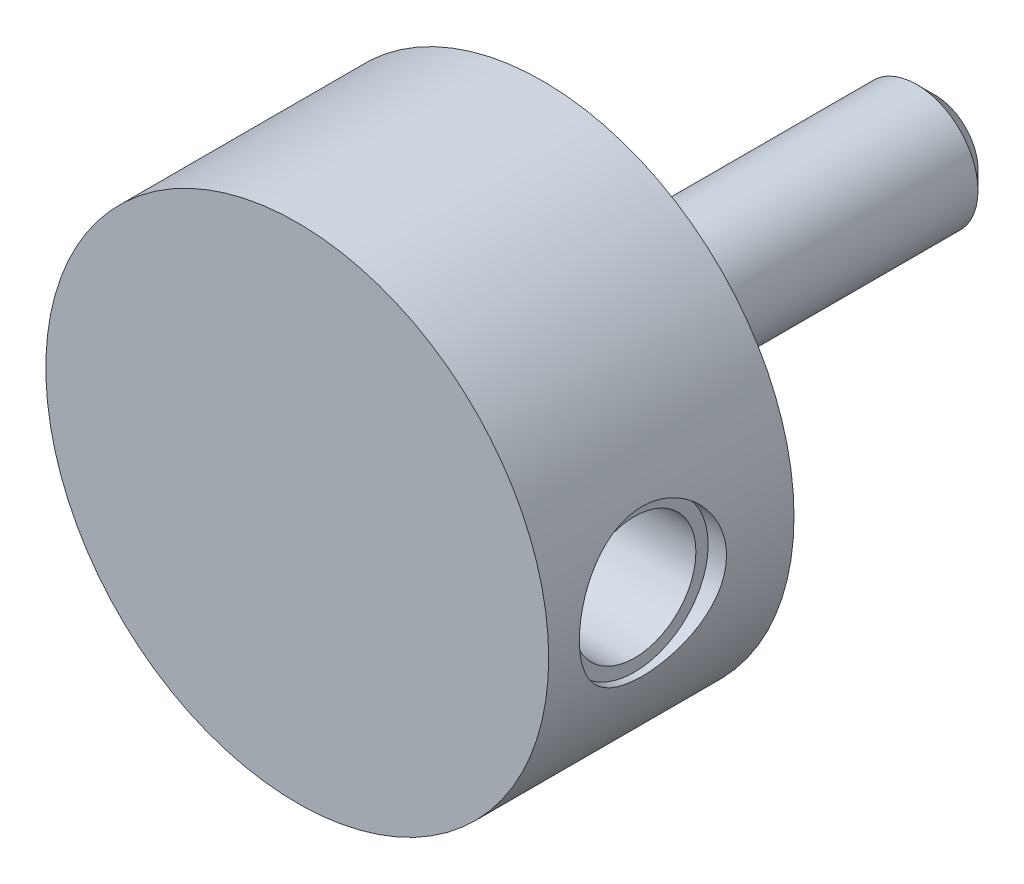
ISO-10303-21;
HEADER;
FILE_DESCRIPTION(('STEP AP214'),'2;1');
FILE_NAME('part.step','',(''),(''),'','','');
FILE_SCHEMA(('AUTOMOTIVE_DESIGN { 1 0 10303 214 1 1 1 1 }'));
ENDSEC;
DATA;
#1=APPLICATION_CONTEXT('core data for automotive mechanical design processes');
#2=APPLICATION_PROTOCOL_DEFINITION('international standard','automotive_design',2000,#1);
#3=PRODUCT_CONTEXT('',#1,'mechanical');
#4=PRODUCT('Part','Part','',(#3));
#5=PRODUCT_RELATED_PRODUCT_CATEGORY('part','',(#4));
#6=PRODUCT_DEFINITION_FORMATION('','',#4);
#7=PRODUCT_DEFINITION_CONTEXT('part definition',#1,'design');
#8=PRODUCT_DEFINITION('design','',#6,#7);
#9=PRODUCT_DEFINITION_SHAPE('','',#8);
#10=(LENGTH_UNIT() NAMED_UNIT(*) SI_UNIT(.MILLI.,.METRE.));
#11=(NAMED_UNIT(*) PLANE_ANGLE_UNIT() SI_UNIT($,.RADIAN.));
#12=(NAMED_UNIT(*) SI_UNIT($,.STERADIAN.) SOLID_ANGLE_UNIT());
#13=UNCERTAINTY_MEASURE_WITH_UNIT(LENGTH_MEASURE(1.E-05),#10,'distance_accuracy_value','');
#14=(GEOMETRIC_REPRESENTATION_CONTEXT(3) GLOBAL_UNCERTAINTY_ASSIGNED_CONTEXT((#13)) GLOBAL_UNIT_ASSIGNED_CONTEXT((#10,
#11,#12)) REPRESENTATION_CONTEXT('',''));
#15=CARTESIAN_POINT('',(0.,0.,0.));
#16=DIRECTION('',(0.,0.,1.));
#17=DIRECTION('',(1.,0.,0.));
#18=AXIS2_PLACEMENT_3D('',#15,#16,#17);
#19=CARTESIAN_POINT('',(0.,0.,0.));
#20=DIRECTION('',(0.,0.,1.));
#21=DIRECTION('',(1.,0.,0.));
#22=AXIS2_PLACEMENT_3D('',#19,#20,#21);
#23=PLANE('',#22);
#24=CARTESIAN_POINT('',(0.,0.,0.));
#25=DIRECTION('',(0.,0.,1.));
#26=DIRECTION('',(1.,0.,0.));
#27=AXIS2_PLACEMENT_3D('',#24,#25,#26);
#28=CIRCLE('',#27,9.5);
#29=CARTESIAN_POINT('',(9.5,0.,0.));
#30=VERTEX_POINT('',#29);
#31=EDGE_CURVE('E27',#30,#30,#28,.T.);
#32=ORIENTED_EDGE('',*,*,#31,.F.);
#33=EDGE_LOOP('',(#32));
#34=FACE_BOUND('',#33,.T.);
#35=CARTESIAN_POINT('',(0.,0.,0.));
#36=DIRECTION('',(0.,0.,1.));
#37=DIRECTION('',(1.,0.,0.));
#38=AXIS2_PLACEMENT_3D('',#35,#36,#37);
#39=CIRCLE('',#38,5.);
#40=CARTESIAN_POINT('',(5.,0.,0.));
#41=VERTEX_POINT('',#40);
#42=EDGE_CURVE('E23',#41,#41,#39,.F.);
#43=ORIENTED_EDGE('',*,*,#42,.F.);
#44=EDGE_LOOP('',(#43));
#45=FACE_BOUND('',#44,.T.);
#46=ADVANCED_FACE('F12',(#34,#45),#23,.F.);
#47=CARTESIAN_POINT('',(0.,0.,40.));
#48=DIRECTION('',(0.,0.,1.));
#49=DIRECTION('',(1.,0.,0.));
#50=AXIS2_PLACEMENT_3D('',#47,#48,#49);
#51=CYLINDRICAL_SURFACE('',#50,9.5);
#52=CARTESIAN_POINT('',(0.,0.,2.));
#53=DIRECTION('',(0.,0.,1.));
#54=DIRECTION('',(1.,0.,0.));
#55=AXIS2_PLACEMENT_3D('',#52,#53,#54);
#56=CIRCLE('',#55,9.5);
#57=CARTESIAN_POINT('',(9.5,0.,2.));
#58=VERTEX_POINT('',#57);
#59=EDGE_CURVE('E38',#58,#58,#56,.T.);
#60=ORIENTED_EDGE('',*,*,#59,.F.);
#61=EDGE_LOOP('',(#60));
#62=FACE_BOUND('',#61,.T.);
#63=ORIENTED_EDGE('',*,*,#31,.T.);
#64=EDGE_LOOP('',(#63));
#65=FACE_BOUND('',#64,.T.);
#66=ADVANCED_FACE('F65',(#62,#65),#51,.T.);
#67=CARTESIAN_POINT('',(20.5,0.,22.));
#68=DIRECTION('',(0.,0.,-1.));
#69=DIRECTION('',(-1.,0.,0.));
#70=AXIS2_PLACEMENT_3D('',#67,#68,#69);
#71=PLANE('',#70);
#72=CARTESIAN_POINT('',(0.,0.,22.));
#73=DIRECTION('',(0.,0.,1.));
#74=DIRECTION('',(1.,0.,0.));
#75=AXIS2_PLACEMENT_3D('',#72,#73,#74);
#76=CIRCLE('',#75,20.5);
#77=CARTESIAN_POINT('',(20.5,0.,22.));
#78=VERTEX_POINT('',#77);
#79=EDGE_CURVE('E82',#78,#78,#76,.T.);
#80=ORIENTED_EDGE('',*,*,#79,.T.);
#81=EDGE_LOOP('',(#80));
#82=FACE_BOUND('',#81,.T.);
#83=ADVANCED_FACE('F60',(#82),#71,.F.);
#84=CARTESIAN_POINT('',(0.,0.,40.));
#85=DIRECTION('',(0.,0.,1.));
#86=DIRECTION('',(1.,0.,0.));
#87=AXIS2_PLACEMENT_3D('',#84,#85,#86);
#88=CYLINDRICAL_SURFACE('',#87,20.5);
#89=CARTESIAN_POINT('',(20.5,0.,7.5));
#90=CARTESIAN_POINT('',(20.4999997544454,-0.164768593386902,7.50000038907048));
#91=CARTESIAN_POINT('',(20.4980087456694,-0.329544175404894,7.50679278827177));
#92=CARTESIAN_POINT('',(20.4900990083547,-0.65788822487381,7.5339021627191));
#93=CARTESIAN_POINT('',(20.4841800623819,-0.821456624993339,7.55421988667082));
#94=CARTESIAN_POINT('',(20.4685766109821,-1.1462122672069,7.60820100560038));
#95=CARTESIAN_POINT('',(20.4588916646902,-1.30739922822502,7.64186596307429));
#96=CARTESIAN_POINT('',(20.4360164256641,-1.62628314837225,7.72226244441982));
#97=CARTESIAN_POINT('',(20.4228249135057,-1.7839788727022,7.76899851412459));
#98=CARTESIAN_POINT('',(20.3933182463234,-2.09448185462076,7.87505403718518));
#99=CARTESIAN_POINT('',(20.3770082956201,-2.24729676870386,7.93435254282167));
#100=CARTESIAN_POINT('',(20.3416823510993,-2.54730770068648,8.06511256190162));
#101=CARTESIAN_POINT('',(20.3226662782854,-2.69450355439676,8.13657443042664));
#102=CARTESIAN_POINT('',(20.2824208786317,-2.98237032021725,8.2911456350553));
#103=CARTESIAN_POINT('',(20.2611910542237,-3.123039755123,8.37425759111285));
#104=CARTESIAN_POINT('',(20.2170775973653,-3.39691169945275,8.55150630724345));
#105=CARTESIAN_POINT('',(20.1941944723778,-3.53011647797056,8.6456396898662));
#106=CARTESIAN_POINT('',(20.146767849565,-3.79154794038,8.84682399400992));
#107=CARTESIAN_POINT('',(20.1221971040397,-3.91956600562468,8.95413966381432));
#108=CARTESIAN_POINT('',(20.0725990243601,-4.1661228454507,9.17897611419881));
#109=CARTESIAN_POINT('',(20.0475718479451,-4.2846648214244,9.29649342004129));
#110=CARTESIAN_POINT('',(19.9977175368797,-4.5116297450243,9.54108035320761));
#111=CARTESIAN_POINT('',(19.9728905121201,-4.62004743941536,9.66815487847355));
#112=CARTESIAN_POINT('',(19.9241410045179,-4.82595045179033,9.93095842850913));
#113=CARTESIAN_POINT('',(19.9002181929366,-4.92343976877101,10.0666842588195));
#114=CARTESIAN_POINT('',(19.8534354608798,-5.10885934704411,10.3490171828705));
#115=CARTESIAN_POINT('',(19.8306098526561,-5.19653638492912,10.4957964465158));
#116=CARTESIAN_POINT('',(19.7872868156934,-5.35913808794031,10.7965125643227));
#117=CARTESIAN_POINT('',(19.766788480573,-5.43406772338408,10.9504465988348));
#118=CARTESIAN_POINT('',(19.7287391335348,-5.57062666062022,11.2645036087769));
#119=CARTESIAN_POINT('',(19.7111887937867,-5.63225293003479,11.4246279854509));
#120=CARTESIAN_POINT('',(19.6796082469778,-5.74162541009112,11.7498143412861));
#121=CARTESIAN_POINT('',(19.6655765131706,-5.78937764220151,11.9148741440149));
#122=CARTESIAN_POINT('',(19.6418018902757,-5.86952471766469,12.2443484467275));
#123=CARTESIAN_POINT('',(19.6319555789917,-5.90229162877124,12.4086649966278));
#124=CARTESIAN_POINT('',(19.6163432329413,-5.95397424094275,12.7395899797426));
#125=CARTESIAN_POINT('',(19.6105755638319,-5.97289549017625,12.9061974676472));
#126=CARTESIAN_POINT('',(19.603301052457,-5.99672775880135,13.2405034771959));
#127=CARTESIAN_POINT('',(19.6017941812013,-6.00163887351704,13.4082019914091));
#128=CARTESIAN_POINT('',(19.6030905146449,-5.99740342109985,13.7434027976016));
#129=CARTESIAN_POINT('',(19.6058936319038,-5.98825713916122,13.9109050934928));
#130=CARTESIAN_POINT('',(19.6155486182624,-5.95655212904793,14.238688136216));
#131=CARTESIAN_POINT('',(19.6222578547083,-5.9344657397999,14.3990190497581));
#132=CARTESIAN_POINT('',(19.6394095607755,-5.87745500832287,14.7172343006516));
#133=CARTESIAN_POINT('',(19.649853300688,-5.84252629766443,14.8751177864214));
#134=CARTESIAN_POINT('',(19.6741615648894,-5.7601395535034,15.187257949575));
#135=CARTESIAN_POINT('',(19.688025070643,-5.71268525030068,15.3415156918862));
#136=CARTESIAN_POINT('',(19.7187796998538,-5.60560692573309,15.6454959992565));
#137=CARTESIAN_POINT('',(19.7356719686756,-5.5459782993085,15.7952168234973));
#138=CARTESIAN_POINT('',(19.7722410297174,-5.41416819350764,16.0910079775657));
#139=CARTESIAN_POINT('',(19.7919506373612,-5.34183608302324,16.2370072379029));
#140=CARTESIAN_POINT('',(19.8334359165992,-5.18568691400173,16.5224423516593));
#141=CARTESIAN_POINT('',(19.8552123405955,-5.10186566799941,16.6618757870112));
#142=CARTESIAN_POINT('',(19.9227548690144,-4.8340177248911,17.0689782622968));
#143=CARTESIAN_POINT('',(19.9707648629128,-4.63350124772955,17.3256854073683));
#144=CARTESIAN_POINT('',(20.0696162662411,-4.18511260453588,17.8126329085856));
#145=CARTESIAN_POINT('',(20.1204944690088,-3.93567819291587,18.0414205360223));
#146=CARTESIAN_POINT('',(20.2176813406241,-3.40132203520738,18.4542852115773));
#147=CARTESIAN_POINT('',(20.2639897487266,-3.11639826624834,18.63835970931));
#148=CARTESIAN_POINT('',(20.3472018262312,-2.51664006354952,18.9573414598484));
#149=CARTESIAN_POINT('',(20.3840462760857,-2.2016334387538,19.0919412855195));
#150=CARTESIAN_POINT('',(20.4437541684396,-1.55212614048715,19.3058343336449));
#151=CARTESIAN_POINT('',(20.4666213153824,-1.21763065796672,19.3851422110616));
#152=CARTESIAN_POINT('',(20.4952175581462,-0.550953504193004,19.4838192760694));
#153=CARTESIAN_POINT('',(20.5015074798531,-0.219085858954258,19.5051506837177));
#154=CARTESIAN_POINT('',(20.4978783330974,0.44350281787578,19.4927506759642));
#155=CARTESIAN_POINT('',(20.4879613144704,0.774223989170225,19.4590262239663));
#156=CARTESIAN_POINT('',(20.4533992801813,1.41781519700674,19.3390673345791));
#157=CARTESIAN_POINT('',(20.4290727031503,1.73091547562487,19.253967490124));
#158=CARTESIAN_POINT('',(20.3684901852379,2.33834273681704,19.0350155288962));
#159=CARTESIAN_POINT('',(20.3322328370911,2.63266749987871,18.901157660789));
#160=CARTESIAN_POINT('',(20.2505580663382,3.201467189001,18.585163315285));
#161=CARTESIAN_POINT('',(20.2049537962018,3.47535043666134,18.4020133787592));
#162=CARTESIAN_POINT('',(20.1098009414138,3.98926947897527,17.9937010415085));
#163=CARTESIAN_POINT('',(20.0602514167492,4.22929716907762,17.7685286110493));
#164=CARTESIAN_POINT('',(19.9860369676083,4.56311282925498,17.3996018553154));
#165=CARTESIAN_POINT('',(19.9608943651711,4.67160496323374,17.2689475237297));
#166=CARTESIAN_POINT('',(19.9116554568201,4.87720494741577,16.9988051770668));
#167=CARTESIAN_POINT('',(19.8875587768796,4.97431688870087,16.8593203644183));
#168=CARTESIAN_POINT('',(19.8411019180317,5.15650338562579,16.5723575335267));
#169=CARTESIAN_POINT('',(19.8187424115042,5.24157329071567,16.4248764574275));
#170=CARTESIAN_POINT('',(19.7764458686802,5.39896546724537,16.1230001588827));
#171=CARTESIAN_POINT('',(19.7565078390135,5.47129297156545,15.9686078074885));
#172=CARTESIAN_POINT('',(19.7197444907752,5.60234699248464,15.6546484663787));
#173=CARTESIAN_POINT('',(19.7029051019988,5.6611353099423,15.49510893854));
#174=CARTESIAN_POINT('',(19.6727610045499,5.76501533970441,15.1713718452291));
#175=CARTESIAN_POINT('',(19.6594548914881,5.81011249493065,15.0071761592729));
#176=CARTESIAN_POINT('',(19.6367999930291,5.88622676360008,14.675294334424));
#177=CARTESIAN_POINT('',(19.6274509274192,5.91724487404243,14.5076084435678));
#178=CARTESIAN_POINT('',(19.6130187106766,5.96490739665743,14.1700260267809));
#179=CARTESIAN_POINT('',(19.6079354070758,5.98155232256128,14.0001295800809));
#180=CARTESIAN_POINT('',(19.6023186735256,5.9999323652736,13.6662567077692));
#181=CARTESIAN_POINT('',(19.6016119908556,6.00223524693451,13.5023141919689));
#182=CARTESIAN_POINT('',(19.6043094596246,5.99341910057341,13.1747666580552));
#183=CARTESIAN_POINT('',(19.6077150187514,5.98229547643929,13.0111617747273));
#184=CARTESIAN_POINT('',(19.6185313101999,5.94672790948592,12.6856110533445));
#185=CARTESIAN_POINT('',(19.6259403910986,5.92228945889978,12.5236645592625));
#186=CARTESIAN_POINT('',(19.6445384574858,5.86030325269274,12.2024601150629));
#187=CARTESIAN_POINT('',(19.6557288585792,5.82275058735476,12.0432031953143));
#188=CARTESIAN_POINT('',(19.6814005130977,5.73537439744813,11.7303823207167));
#189=CARTESIAN_POINT('',(19.6958418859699,5.68569901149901,11.5767736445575));
#190=CARTESIAN_POINT('',(19.7276768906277,5.57423736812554,11.2742707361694));
#191=CARTESIAN_POINT('',(19.7450715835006,5.51244675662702,11.125378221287));
#192=CARTESIAN_POINT('',(19.782319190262,5.37724463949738,10.8333301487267));
#193=CARTESIAN_POINT('',(19.802171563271,5.30383568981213,10.6901733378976));
#194=CARTESIAN_POINT('',(19.8438063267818,5.14587421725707,10.4103722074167));
#195=CARTESIAN_POINT('',(19.8655894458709,5.061317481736,10.2737303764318));
#196=CARTESIAN_POINT('',(19.9112797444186,4.87853600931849,10.0032239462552));
#197=CARTESIAN_POINT('',(19.9352342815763,4.77994030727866,9.86961789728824));
#198=CARTESIAN_POINT('',(19.9839347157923,4.57206196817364,9.61107007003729));
#199=CARTESIAN_POINT('',(20.0086809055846,4.46277534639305,9.48613155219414));
#200=CARTESIAN_POINT('',(20.0582834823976,4.23425660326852,9.24575891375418));
#201=CARTESIAN_POINT('',(20.0831398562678,4.11502564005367,9.13032368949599));
#202=CARTESIAN_POINT('',(20.1323098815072,3.86730499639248,8.90963180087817));
#203=CARTESIAN_POINT('',(20.1566233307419,3.7388119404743,8.80437888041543));
#204=CARTESIAN_POINT('',(20.2046974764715,3.46977987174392,8.6020699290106));
#205=CARTESIAN_POINT('',(20.2284250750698,3.32900807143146,8.50531528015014));
#206=CARTESIAN_POINT('',(20.2739466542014,3.03949915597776,8.32403500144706));
#207=CARTESIAN_POINT('',(20.2957406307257,2.8907620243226,8.23950939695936));
#208=CARTESIAN_POINT('',(20.3367679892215,2.58639447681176,8.0833769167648));
#209=CARTESIAN_POINT('',(20.356002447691,2.43076699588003,8.01176460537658));
#210=CARTESIAN_POINT('',(20.3913677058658,2.11366097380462,7.88201306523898));
#211=CARTESIAN_POINT('',(20.4074988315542,1.95218304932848,7.82387242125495));
#212=CARTESIAN_POINT('',(20.4344672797,1.64423058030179,7.72771145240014));
#213=CARTESIAN_POINT('',(20.4457076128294,1.49828162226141,7.68811373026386));
#214=CARTESIAN_POINT('',(20.4651675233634,1.2036242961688,7.62002138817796));
#215=CARTESIAN_POINT('',(20.4733873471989,1.0549161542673,7.59152586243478));
#216=CARTESIAN_POINT('',(20.4866168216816,0.755624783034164,7.54584620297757));
#217=CARTESIAN_POINT('',(20.491626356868,0.605041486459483,7.52866247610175));
#218=CARTESIAN_POINT('',(20.49831762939,0.302973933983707,7.50574067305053));
#219=CARTESIAN_POINT('',(20.5000002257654,0.151489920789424,7.49999964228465));
#220=CARTESIAN_POINT('',(20.5,0.,7.5));
#221=B_SPLINE_CURVE_WITH_KNOTS('',3,(#89,#90,#91,#92,#93,#94,#95,#96,#97,#98,#99,#100,#101,#102,
#103,#104,#105,#106,#107,#108,#109,#110,#111,#112,#113,#114,#115,#116,#117,#118,#119,#120,#121,
#122,#123,#124,#125,#126,#127,#128,#129,#130,#131,#132,#133,#134,#135,#136,#137,#138,#139,#140,
#141,#142,#143,#144,#145,#146,#147,#148,#149,#150,#151,#152,#153,#154,#155,#156,#157,#158,#159,
#160,#161,#162,#163,#164,#165,#166,#167,#168,#169,#170,#171,#172,#173,#174,#175,#176,#177,#178,
#179,#180,#181,#182,#183,#184,#185,#186,#187,#188,#189,#190,#191,#192,#193,#194,#195,#196,#197,
#198,#199,#200,#201,#202,#203,#204,#205,#206,#207,#208,#209,#210,#211,#212,#213,#214,#215,#216,
#217,#218,#219,#220),.UNSPECIFIED.,.T.,.F.,(4,2,2,2,2,2,2,2,2,2,2,2,2,2,2,2,2,2,2,2,2,2,2,2,2,2,
2,2,2,2,2,2,2,2,2,2,2,2,2,2,2,2,2,2,2,2,2,2,2,2,2,2,2,2,2,2,2,2,2,2,2,2,2,2,2,4),(0.,
0.494166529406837,0.988360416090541,1.48261217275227,1.97703603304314,2.47064184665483,
2.96426207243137,3.45799348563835,3.95157399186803,4.45753270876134,4.96331976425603,
5.46936781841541,5.97523008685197,6.49206535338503,7.00869863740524,7.52544955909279,
8.04197586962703,8.54486934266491,9.04756118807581,9.55024961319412,10.0529278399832,
10.5383093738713,11.0238561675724,11.5092585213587,11.9948448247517,12.4866344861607,
12.9786038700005,13.9617709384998,14.9839152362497,16.006117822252,17.0345689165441,
18.062747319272,19.0556662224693,20.0484595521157,21.0200911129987,21.9918373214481,
22.9853318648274,23.97906383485,24.4935931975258,25.0079370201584,25.5224789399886,
26.0368090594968,26.5487427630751,27.0604726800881,27.5721663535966,28.0838417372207,
28.5751252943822,29.066577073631,29.5578262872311,30.0492596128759,30.5349645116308,
31.0208442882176,31.5066173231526,31.9925744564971,32.4953010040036,32.9982156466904,
33.5010718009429,34.0041121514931,34.5208552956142,35.0375995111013,35.5541256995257,
36.0705976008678,36.525077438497,36.9795201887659,37.4339792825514,37.8883210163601),.UNSPECIFIED.);
#222=CARTESIAN_POINT('',(20.5,0.,7.5));
#223=VERTEX_POINT('',#222);
#224=EDGE_CURVE('E30',#223,#223,#221,.T.);
#225=ORIENTED_EDGE('',*,*,#224,.T.);
#226=EDGE_LOOP('',(#225));
#227=FACE_BOUND('',#226,.T.);
#228=ORIENTED_EDGE('',*,*,#79,.F.);
#229=EDGE_LOOP('',(#228));
#230=FACE_BOUND('',#229,.T.);
#231=CARTESIAN_POINT('',(0.,0.,2.));
#232=DIRECTION('',(0.,0.,1.));
#233=DIRECTION('',(1.,0.,0.));
#234=AXIS2_PLACEMENT_3D('',#231,#232,#233);
#235=CIRCLE('',#234,20.5);
#236=CARTESIAN_POINT('',(20.5,0.,2.));
#237=VERTEX_POINT('',#236);
#238=EDGE_CURVE('E84',#237,#237,#235,.T.);
#239=ORIENTED_EDGE('',*,*,#238,.T.);
#240=EDGE_LOOP('',(#239));
#241=FACE_BOUND('',#240,.T.);
#242=ADVANCED_FACE('F41',(#227,#230,#241),#88,.T.);
#243=CARTESIAN_POINT('',(9.5,0.,2.));
#244=DIRECTION('',(0.,0.,1.));
#245=DIRECTION('',(1.,0.,0.));
#246=AXIS2_PLACEMENT_3D('',#243,#244,#245);
#247=PLANE('',#246);
#248=ORIENTED_EDGE('',*,*,#238,.F.);
#249=EDGE_LOOP('',(#248));
#250=FACE_BOUND('',#249,.T.);
#251=ORIENTED_EDGE('',*,*,#59,.T.);
#252=EDGE_LOOP('',(#251));
#253=FACE_BOUND('',#252,.T.);
#254=ADVANCED_FACE('F49',(#250,#253),#247,.F.);
#255=CARTESIAN_POINT('',(19.,0.,13.5));
#256=DIRECTION('',(1.,0.,0.));
#257=DIRECTION('',(0.,0.,-1.));
#258=AXIS2_PLACEMENT_3D('',#255,#256,#257);
#259=CYLINDRICAL_SURFACE('',#258,6.);
#260=CARTESIAN_POINT('',(19.,0.,13.5));
#261=DIRECTION('',(1.,0.,0.));
#262=DIRECTION('',(0.,0.,-1.));
#263=AXIS2_PLACEMENT_3D('',#260,#261,#262);
#264=CIRCLE('',#263,6.);
#265=CARTESIAN_POINT('',(19.,0.,7.5));
#266=VERTEX_POINT('',#265);
#267=EDGE_CURVE('E39',#266,#266,#264,.T.);
#268=ORIENTED_EDGE('',*,*,#267,.F.);
#269=EDGE_LOOP('',(#268));
#270=FACE_BOUND('',#269,.T.);
#271=ORIENTED_EDGE('',*,*,#224,.F.);
#272=EDGE_LOOP('',(#271));
#273=FACE_BOUND('',#272,.T.);
#274=ADVANCED_FACE('F47',(#270,#273),#259,.F.);
#275=CARTESIAN_POINT('',(19.,0.,13.5));
#276=DIRECTION('',(1.,0.,0.));
#277=DIRECTION('',(0.,0.,-1.));
#278=AXIS2_PLACEMENT_3D('',#275,#276,#277);
#279=PLANE('',#278);
#280=CARTESIAN_POINT('',(19.,0.,13.5));
#281=DIRECTION('',(1.,0.,0.));
#282=DIRECTION('',(0.,0.,-1.));
#283=AXIS2_PLACEMENT_3D('',#280,#281,#282);
#284=CIRCLE('',#283,5.);
#285=CARTESIAN_POINT('',(19.,0.,8.5));
#286=VERTEX_POINT('',#285);
#287=EDGE_CURVE('E96',#286,#286,#284,.T.);
#288=ORIENTED_EDGE('',*,*,#287,.F.);
#289=EDGE_LOOP('',(#288));
#290=FACE_BOUND('',#289,.T.);
#291=ORIENTED_EDGE('',*,*,#267,.T.);
#292=EDGE_LOOP('',(#291));
#293=FACE_BOUND('',#292,.T.);
#294=ADVANCED_FACE('F58',(#290,#293),#279,.T.);
#295=CARTESIAN_POINT('',(10.,0.,13.5));
#296=DIRECTION('',(1.,0.,0.));
#297=DIRECTION('',(0.,0.,-1.));
#298=AXIS2_PLACEMENT_3D('',#295,#296,#297);
#299=CYLINDRICAL_SURFACE('',#298,5.);
#300=CARTESIAN_POINT('',(10.,0.,13.5));
#301=DIRECTION('',(1.,0.,0.));
#302=DIRECTION('',(0.,0.,-1.));
#303=AXIS2_PLACEMENT_3D('',#300,#301,#302);
#304=CIRCLE('',#303,5.);
#305=CARTESIAN_POINT('',(10.,0.,8.5));
#306=VERTEX_POINT('',#305);
#307=EDGE_CURVE('E93',#306,#306,#304,.T.);
#308=ORIENTED_EDGE('',*,*,#307,.F.);
#309=EDGE_LOOP('',(#308));
#310=FACE_BOUND('',#309,.T.);
#311=ORIENTED_EDGE('',*,*,#287,.T.);
#312=EDGE_LOOP('',(#311));
#313=FACE_BOUND('',#312,.T.);
#314=ADVANCED_FACE('F100',(#310,#313),#299,.F.);
#315=CARTESIAN_POINT('',(10.,0.,13.5));
#316=DIRECTION('',(1.,0.,0.));
#317=DIRECTION('',(0.,0.,-1.));
#318=AXIS2_PLACEMENT_3D('',#315,#316,#317);
#319=PLANE('',#318);
#320=ORIENTED_EDGE('',*,*,#307,.T.);
#321=EDGE_LOOP('',(#320));
#322=FACE_BOUND('',#321,.T.);
#323=ADVANCED_FACE('F112',(#322),#319,.T.);
#324=CARTESIAN_POINT('',(0.,0.,-30.));
#325=DIRECTION('',(0.,0.,1.));
#326=DIRECTION('',(1.,0.,0.));
#327=AXIS2_PLACEMENT_3D('',#324,#325,#326);
#328=CYLINDRICAL_SURFACE('',#327,5.);
#329=CARTESIAN_POINT('',(0.,0.,-28.5));
#330=DIRECTION('',(0.,0.,-1.));
#331=DIRECTION('',(-1.,0.,0.));
#332=AXIS2_PLACEMENT_3D('',#329,#330,#331);
#333=CIRCLE('',#332,5.);
#334=CARTESIAN_POINT('',(-5.,0.,-28.5));
#335=VERTEX_POINT('',#334);
#336=EDGE_CURVE('E8',#335,#335,#333,.F.);
#337=ORIENTED_EDGE('',*,*,#336,.T.);
#338=EDGE_LOOP('',(#337));
#339=FACE_BOUND('',#338,.T.);
#340=ORIENTED_EDGE('',*,*,#42,.T.);
#341=EDGE_LOOP('',(#340));
#342=FACE_BOUND('',#341,.T.);
#343=ADVANCED_FACE('F118',(#339,#342),#328,.T.);
#344=CARTESIAN_POINT('',(0.,0.,-30.));
#345=DIRECTION('',(0.,0.,-1.));
#346=DIRECTION('',(-1.,0.,0.));
#347=AXIS2_PLACEMENT_3D('',#344,#345,#346);
#348=PLANE('',#347);
#349=CARTESIAN_POINT('',(0.,0.,-30.));
#350=DIRECTION('',(0.,0.,-1.));
#351=DIRECTION('',(-1.,0.,0.));
#352=AXIS2_PLACEMENT_3D('',#349,#350,#351);
#353=CIRCLE('',#352,3.5);
#354=CARTESIAN_POINT('',(-3.5,0.,-30.));
#355=VERTEX_POINT('',#354);
#356=EDGE_CURVE('E19',#355,#355,#353,.T.);
#357=ORIENTED_EDGE('',*,*,#356,.T.);
#358=EDGE_LOOP('',(#357));
#359=FACE_BOUND('',#358,.T.);
#360=ADVANCED_FACE('F122',(#359),#348,.T.);
#361=CARTESIAN_POINT('',(0.,0.,-30.));
#362=DIRECTION('',(0.,0.,1.));
#363=DIRECTION('',(1.,0.,0.));
#364=AXIS2_PLACEMENT_3D('',#361,#362,#363);
#365=CONICAL_SURFACE('',#364,3.5,0.785398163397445);
#366=ORIENTED_EDGE('',*,*,#336,.F.);
#367=EDGE_LOOP('',(#366));
#368=FACE_BOUND('',#367,.T.);
#369=ORIENTED_EDGE('',*,*,#356,.F.);
#370=EDGE_LOOP('',(#369));
#371=FACE_BOUND('',#370,.T.);
#372=ADVANCED_FACE('F14',(#368,#371),#365,.T.);
#373=CLOSED_SHELL('',(#46,#66,#83,#242,#254,#274,#294,#314,#323,#343,#360,#372));
#374=MANIFOLD_SOLID_BREP('B1',#373);
#375=ADVANCED_BREP_SHAPE_REPRESENTATION('',(#18,#374),#14);
#376=SHAPE_DEFINITION_REPRESENTATION(#9,#375);
ENDSEC;
END-ISO-10303-21;
